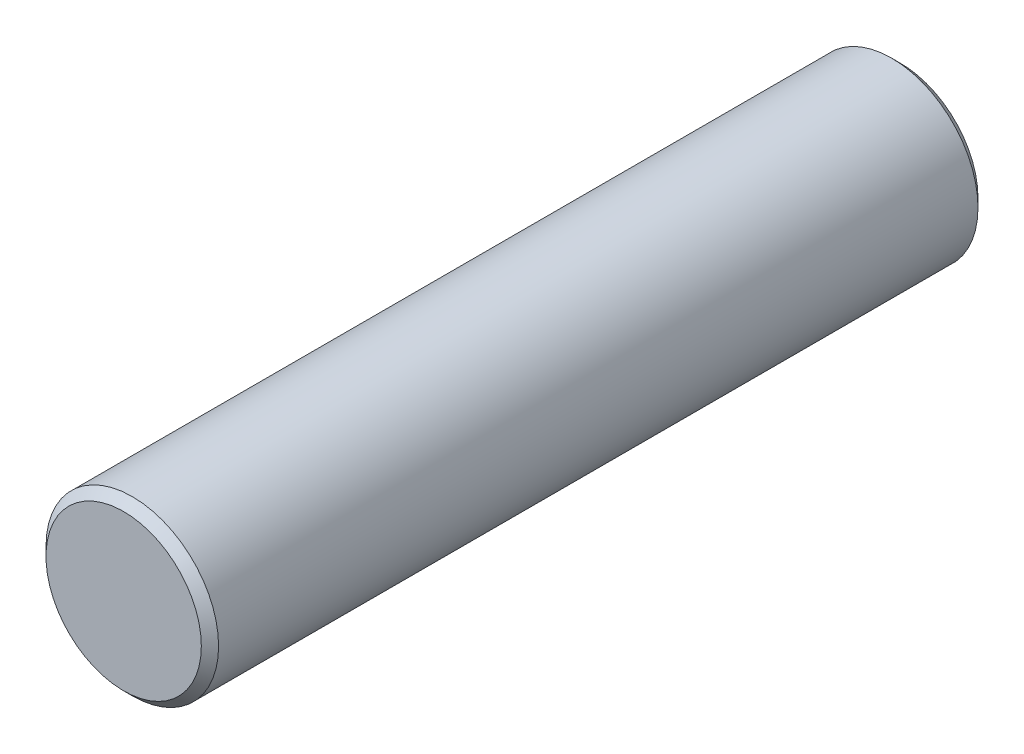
from build123d import *

# Parameters (mm, degrees)
ESQUISSE1_R            = 2
BASE_CYLINDRIQUE_DEPTH = 18
CHANFREINS_SIZE        = 0.2


with BuildPart() as part:
    # Esquisse1 → Base cylindrique (new body)
    with BuildSketch(Plane.XY):
        Circle(ESQUISSE1_R)
    extrude(amount=BASE_CYLINDRIQUE_DEPTH)

    # Chanfreins
    chanfreins_edges = [part.edges().sort_by_distance(p)[0] for p in [
        (-2, 0, 0),
        (-2, 0, 18),
    ]]
    chamfer(chanfreins_edges, length=CHANFREINS_SIZE)


solid = part.part
